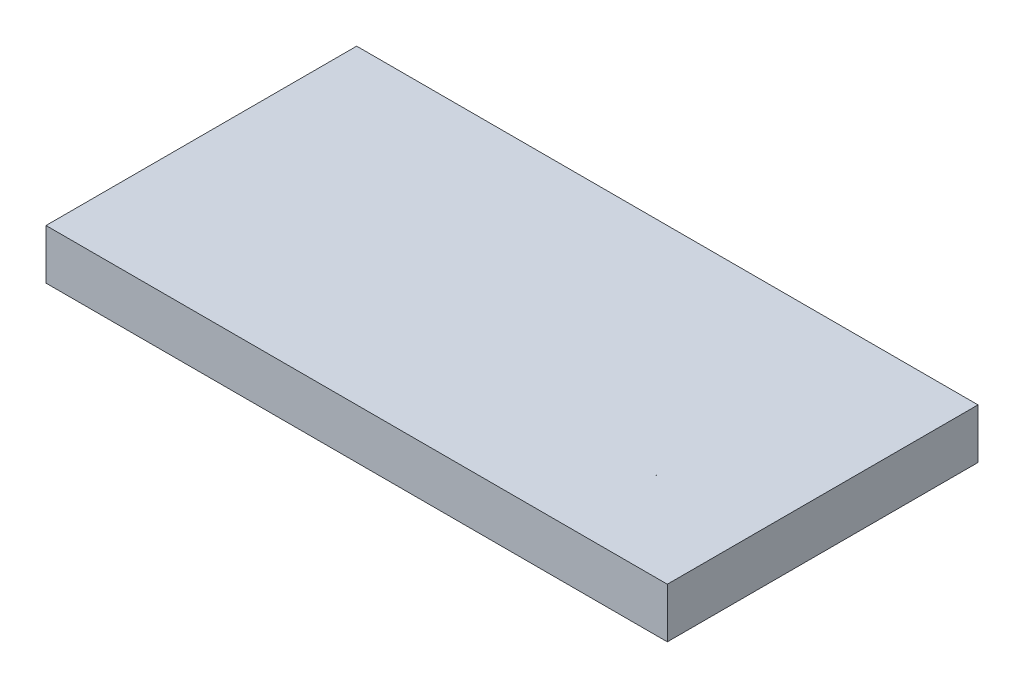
from build123d import *

# Parameters (mm, degrees)
SKETCH1_W                          = 355.6
SKETCH1_H                          = 15.875
BASE_EXTRUDE_DEPTH                 = 88.9
SKETCH6_W                          = 355.6
SKETCH6_H                          = 177.8
SKETCH6_W_2                        = 304.8
SKETCH6_H_2                        = 127
BOSS_EXTRUDE1_DEPTH                = 12.7
F_97_0_005900_DIAMETER_HOLE1_D     = 0.14986
F_97_0_005900_DIAMETER_HOLE1_DEPTH = 38.1


with BuildPart() as part:
    # Sketch1 → Base-Extrude (new, symmetric)
    with BuildSketch(Plane.XY):
        with Locations((0, 7.9375)):
            Rectangle(SKETCH1_W, SKETCH1_H)
    extrude(amount=BASE_EXTRUDE_DEPTH, both=True)

    # Sketch6 → Boss-Extrude1 (add)
    with BuildSketch(Plane.XZ):
        Rectangle(SKETCH6_W, SKETCH6_H)
        Rectangle(SKETCH6_W_2, SKETCH6_H_2, mode=Mode.SUBTRACT)
    extrude(amount=BOSS_EXTRUDE1_DEPTH)

    # 97 _0.005900_ Diameter Hole1
    with Locations(Plane(origin=(50.8, 25.4, 0), x_dir=(-1, 0, 0), z_dir=(0, 1, 0))):
        with Locations((69.85, 38.1), (69.85, -38.1), (-69.85, -38.1), (-69.85, 38.1)):
            Hole(F_97_0_005900_DIAMETER_HOLE1_D / 2, depth=F_97_0_005900_DIAMETER_HOLE1_DEPTH)


solid = part.part
